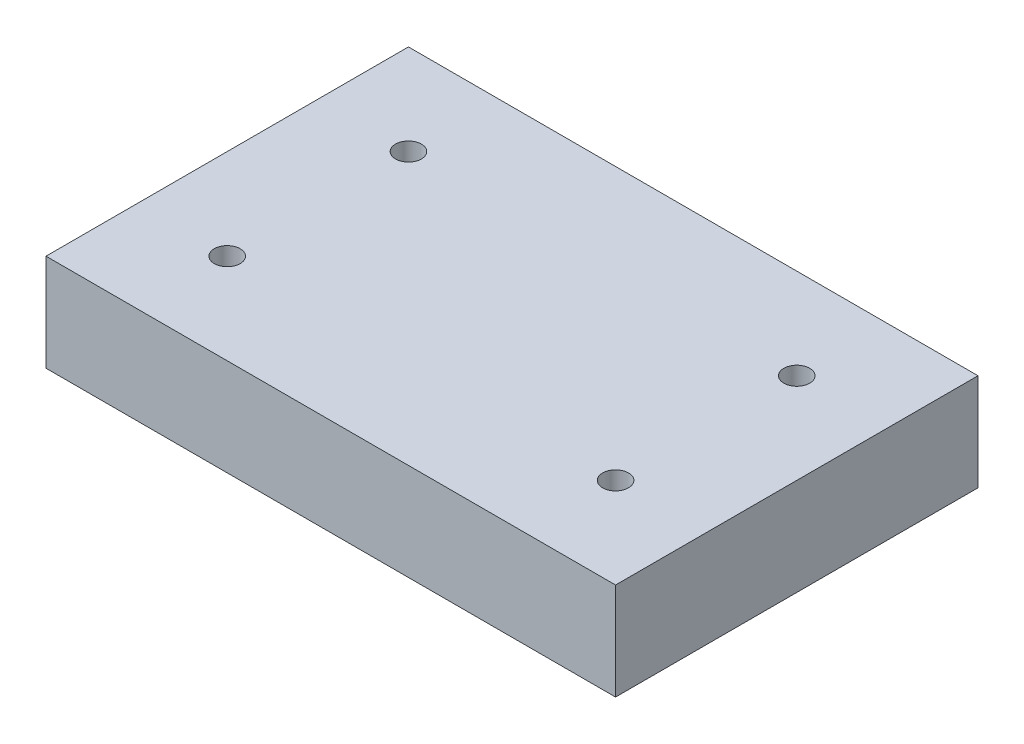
from build123d import *

# Parameters (mm, degrees)
SKETCH1_W                   = 139.7
SKETCH1_H                   = 88.9
BOSS_EXTRUDE1_DEPTH         = 23.8125
F_1_4_0_25_DIAMETER_HOLE1_D = 6.35


with BuildPart() as part:
    # Sketch1 → Boss-Extrude1 (new body)
    with BuildSketch(Plane(origin=(0, 0, 0), x_dir=(1, 0, 0), z_dir=(0, 1, 0))):
        with Locations((69.85, 44.45)):
            Rectangle(SKETCH1_W, SKETCH1_H)
    extrude(amount=BOSS_EXTRUDE1_DEPTH)

    # 1_4 _0.25_ Diameter Hole1 (through all)
    with Locations(Plane(origin=(0, 23.8125, 0), x_dir=(1, 0, 0), z_dir=(0, 1, 0))):
        with Locations((22.225, 66.675), (117.475, 66.675), (117.475, 22.225), (22.225, 22.225)):
            Hole(F_1_4_0_25_DIAMETER_HOLE1_D / 2)


solid = part.part
